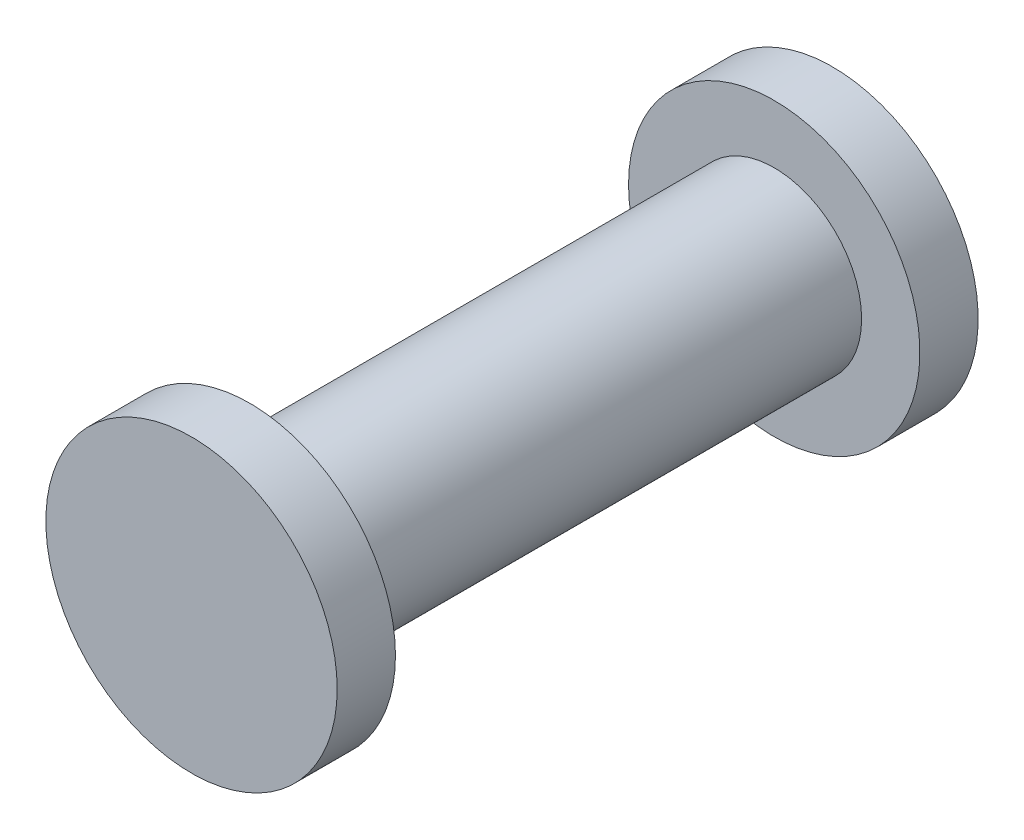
from build123d import *

# Parameters (mm, degrees)
ESQUISSE1_R          = 1.5
BASE_EXTRUSION_DEPTH = 9
ESQUISSE2_R          = 2.5
BOSS_EXTRU_1_DEPTH   = 1
BOSS_EXTRU_2_START   = 1
ESQUISSE3_R          = 2.5
BOSS_EXTRU_2_DEPTH   = 1


with BuildPart() as part:
    # Esquisse1 → Base-Extrusion (new body)
    with BuildSketch(Plane.XY):
        with Locations((66.5, 0.482120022)):
            Circle(ESQUISSE1_R)
    extrude(amount=-BASE_EXTRUSION_DEPTH)

    # Esquisse2 → Boss.-Extru.1 (add)
    with BuildSketch(Plane(origin=(0, 0, -9), x_dir=(-1, 0, 0), z_dir=(0, 0, -1))):
        with Locations((-66.5, 0.482120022)):
            Circle(ESQUISSE2_R)
    extrude(amount=BOSS_EXTRU_1_DEPTH)

    # Esquisse3 → Boss.-Extru.2 (add)
    with BuildSketch(Plane.XY.offset(BOSS_EXTRU_2_START)):
        with Locations(Location((66.5, 0.482120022, 0), (0, 0, 180))):
            Circle(ESQUISSE3_R)
    extrude(amount=-BOSS_EXTRU_2_DEPTH)


solid = part.part
